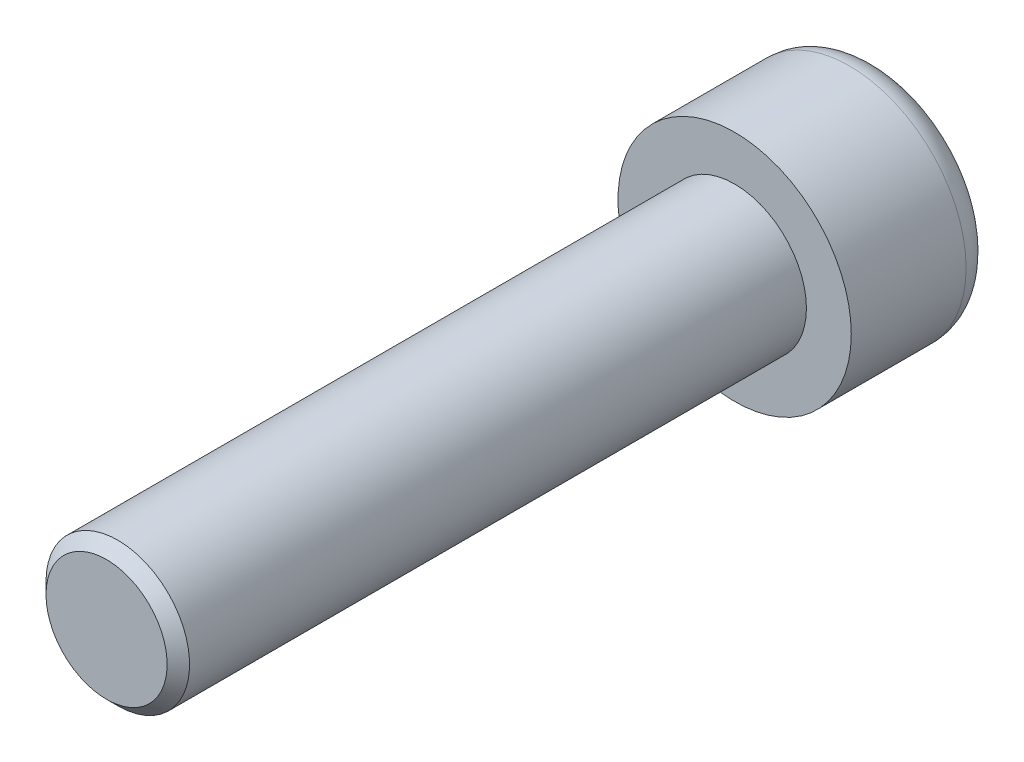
ISO-10303-21;
HEADER;
FILE_DESCRIPTION(('STEP AP214'),'2;1');
FILE_NAME('part.step','',(''),(''),'','','');
FILE_SCHEMA(('AUTOMOTIVE_DESIGN { 1 0 10303 214 1 1 1 1 }'));
ENDSEC;
DATA;
#1=APPLICATION_CONTEXT('core data for automotive mechanical design processes');
#2=APPLICATION_PROTOCOL_DEFINITION('international standard','automotive_design',2000,#1);
#3=PRODUCT_CONTEXT('',#1,'mechanical');
#4=PRODUCT('Part','Part','',(#3));
#5=PRODUCT_RELATED_PRODUCT_CATEGORY('part','',(#4));
#6=PRODUCT_DEFINITION_FORMATION('','',#4);
#7=PRODUCT_DEFINITION_CONTEXT('part definition',#1,'design');
#8=PRODUCT_DEFINITION('design','',#6,#7);
#9=PRODUCT_DEFINITION_SHAPE('','',#8);
#10=(LENGTH_UNIT() NAMED_UNIT(*) SI_UNIT(.MILLI.,.METRE.));
#11=(NAMED_UNIT(*) PLANE_ANGLE_UNIT() SI_UNIT($,.RADIAN.));
#12=(NAMED_UNIT(*) SI_UNIT($,.STERADIAN.) SOLID_ANGLE_UNIT());
#13=UNCERTAINTY_MEASURE_WITH_UNIT(LENGTH_MEASURE(1.E-05),#10,'distance_accuracy_value','');
#14=(GEOMETRIC_REPRESENTATION_CONTEXT(3) GLOBAL_UNCERTAINTY_ASSIGNED_CONTEXT((#13)) GLOBAL_UNIT_ASSIGNED_CONTEXT((#10,
#11,#12)) REPRESENTATION_CONTEXT('',''));
#15=CARTESIAN_POINT('',(0.,0.,0.));
#16=DIRECTION('',(0.,0.,1.));
#17=DIRECTION('',(1.,0.,0.));
#18=AXIS2_PLACEMENT_3D('',#15,#16,#17);
#19=CARTESIAN_POINT('',(0.,0.,8.00000000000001));
#20=DIRECTION('',(0.,0.,1.));
#21=DIRECTION('',(1.,0.,0.));
#22=AXIS2_PLACEMENT_3D('',#19,#20,#21);
#23=PLANE('',#22);
#24=CARTESIAN_POINT('',(0.,0.,8.00000000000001));
#25=DIRECTION('',(0.,0.,1.));
#26=DIRECTION('',(1.,0.,0.));
#27=AXIS2_PLACEMENT_3D('',#24,#25,#26);
#28=CIRCLE('',#27,6.5);
#29=CARTESIAN_POINT('',(6.5,0.,8.00000000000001));
#30=VERTEX_POINT('',#29);
#31=EDGE_CURVE('E134',#30,#30,#28,.T.);
#32=ORIENTED_EDGE('',*,*,#31,.T.);
#33=EDGE_LOOP('',(#32));
#34=FACE_BOUND('',#33,.T.);
#35=CARTESIAN_POINT('',(0.,0.,8.00000000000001));
#36=DIRECTION('',(0.,0.,1.));
#37=DIRECTION('',(1.,0.,0.));
#38=AXIS2_PLACEMENT_3D('',#35,#36,#37);
#39=CIRCLE('',#38,4.);
#40=CARTESIAN_POINT('',(4.,0.,8.00000000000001));
#41=VERTEX_POINT('',#40);
#42=EDGE_CURVE('E193',#41,#41,#39,.T.);
#43=ORIENTED_EDGE('',*,*,#42,.F.);
#44=EDGE_LOOP('',(#43));
#45=FACE_BOUND('',#44,.T.);
#46=ADVANCED_FACE('F32',(#34,#45),#23,.T.);
#47=CARTESIAN_POINT('',(0.,0.,8.00000000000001));
#48=DIRECTION('',(0.,0.,-1.));
#49=DIRECTION('',(-1.,0.,0.));
#50=AXIS2_PLACEMENT_3D('',#47,#48,#49);
#51=CYLINDRICAL_SURFACE('',#50,6.5);
#52=CARTESIAN_POINT('',(0.,0.,1.6));
#53=DIRECTION('',(0.,0.,1.));
#54=DIRECTION('',(1.,0.,0.));
#55=AXIS2_PLACEMENT_3D('',#52,#53,#54);
#56=CIRCLE('',#55,6.5);
#57=CARTESIAN_POINT('',(6.5,0.,1.6));
#58=VERTEX_POINT('',#57);
#59=EDGE_CURVE('E40',#58,#58,#56,.T.);
#60=ORIENTED_EDGE('',*,*,#59,.T.);
#61=EDGE_LOOP('',(#60));
#62=FACE_BOUND('',#61,.T.);
#63=ORIENTED_EDGE('',*,*,#31,.F.);
#64=EDGE_LOOP('',(#63));
#65=FACE_BOUND('',#64,.T.);
#66=ADVANCED_FACE('F34',(#62,#65),#51,.T.);
#67=CARTESIAN_POINT('',(0.,0.,0.));
#68=DIRECTION('',(0.,0.,1.));
#69=DIRECTION('',(1.,0.,0.));
#70=AXIS2_PLACEMENT_3D('',#67,#68,#69);
#71=PLANE('',#70);
#72=CARTESIAN_POINT('',(0.,0.,0.));
#73=DIRECTION('',(0.,0.,1.));
#74=DIRECTION('',(1.,0.,0.));
#75=AXIS2_PLACEMENT_3D('',#72,#73,#74);
#76=CIRCLE('',#75,4.9);
#77=CARTESIAN_POINT('',(4.9,0.,0.));
#78=VERTEX_POINT('',#77);
#79=EDGE_CURVE('E11',#78,#78,#76,.F.);
#80=ORIENTED_EDGE('',*,*,#79,.T.);
#81=EDGE_LOOP('',(#80));
#82=FACE_BOUND('',#81,.T.);
#83=DIRECTION('',(0.86602540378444,-0.499999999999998,0.));
#84=VECTOR('',#83,1.);
#85=CARTESIAN_POINT('',(0.,3.46410161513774,0.));
#86=LINE('',#85,#84);
#87=CARTESIAN_POINT('',(0.,3.46410161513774,0.));
#88=VERTEX_POINT('',#87);
#89=CARTESIAN_POINT('',(3.,1.73205080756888,0.));
#90=VERTEX_POINT('',#89);
#91=EDGE_CURVE('E101',#88,#90,#86,.T.);
#92=ORIENTED_EDGE('',*,*,#91,.F.);
#93=DIRECTION('',(0.86602540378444,0.499999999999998,0.));
#94=VECTOR('',#93,1.);
#95=CARTESIAN_POINT('',(0.,3.46410161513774,0.));
#96=LINE('',#95,#94);
#97=CARTESIAN_POINT('',(-3.,1.73205080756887,0.));
#98=VERTEX_POINT('',#97);
#99=EDGE_CURVE('E47',#98,#88,#96,.T.);
#100=ORIENTED_EDGE('',*,*,#99,.F.);
#101=DIRECTION('',(0.,1.,0.));
#102=VECTOR('',#101,1.);
#103=CARTESIAN_POINT('',(-3.,1.73205080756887,0.));
#104=LINE('',#103,#102);
#105=CARTESIAN_POINT('',(-3.,-1.73205080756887,0.));
#106=VERTEX_POINT('',#105);
#107=EDGE_CURVE('E116',#106,#98,#104,.T.);
#108=ORIENTED_EDGE('',*,*,#107,.F.);
#109=DIRECTION('',(-0.86602540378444,0.499999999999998,0.));
#110=VECTOR('',#109,1.);
#111=CARTESIAN_POINT('',(-3.,-1.73205080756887,0.));
#112=LINE('',#111,#110);
#113=CARTESIAN_POINT('',(0.,-3.46410161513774,0.));
#114=VERTEX_POINT('',#113);
#115=EDGE_CURVE('E110',#114,#106,#112,.T.);
#116=ORIENTED_EDGE('',*,*,#115,.F.);
#117=DIRECTION('',(-0.86602540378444,-0.499999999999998,0.));
#118=VECTOR('',#117,1.);
#119=CARTESIAN_POINT('',(3.,-1.73205080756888,0.));
#120=LINE('',#119,#118);
#121=CARTESIAN_POINT('',(3.,-1.73205080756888,0.));
#122=VERTEX_POINT('',#121);
#123=EDGE_CURVE('E108',#122,#114,#120,.T.);
#124=ORIENTED_EDGE('',*,*,#123,.F.);
#125=DIRECTION('',(0.,-1.,0.));
#126=VECTOR('',#125,1.);
#127=CARTESIAN_POINT('',(3.,1.73205080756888,0.));
#128=LINE('',#127,#126);
#129=EDGE_CURVE('E90',#90,#122,#128,.T.);
#130=ORIENTED_EDGE('',*,*,#129,.F.);
#131=EDGE_LOOP('',(#92,#100,#108,#116,#124,#130));
#132=FACE_BOUND('',#131,.T.);
#133=ADVANCED_FACE('F105',(#82,#132),#71,.F.);
#134=CARTESIAN_POINT('',(0.,3.46410161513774,5.));
#135=DIRECTION('',(-0.499999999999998,0.86602540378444,0.));
#136=DIRECTION('',(-0.86602540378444,-0.499999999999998,0.));
#137=AXIS2_PLACEMENT_3D('',#134,#135,#136);
#138=PLANE('',#137);
#139=ORIENTED_EDGE('',*,*,#99,.T.);
#140=DIRECTION('',(0.,0.,-1.));
#141=VECTOR('',#140,1.);
#142=CARTESIAN_POINT('',(0.,3.46410161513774,5.));
#143=LINE('',#142,#141);
#144=CARTESIAN_POINT('',(0.,3.46410161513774,5.));
#145=VERTEX_POINT('',#144);
#146=EDGE_CURVE('E98',#145,#88,#143,.T.);
#147=ORIENTED_EDGE('',*,*,#146,.F.);
#148=DIRECTION('',(0.86602540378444,0.499999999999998,0.));
#149=VECTOR('',#148,1.);
#150=CARTESIAN_POINT('',(0.,3.46410161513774,5.));
#151=LINE('',#150,#149);
#152=CARTESIAN_POINT('',(-3.,1.73205080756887,5.));
#153=VERTEX_POINT('',#152);
#154=EDGE_CURVE('E118',#153,#145,#151,.T.);
#155=ORIENTED_EDGE('',*,*,#154,.F.);
#156=DIRECTION('',(0.,0.,-1.));
#157=VECTOR('',#156,1.);
#158=CARTESIAN_POINT('',(-3.,1.73205080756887,5.));
#159=LINE('',#158,#157);
#160=EDGE_CURVE('E54',#153,#98,#159,.T.);
#161=ORIENTED_EDGE('',*,*,#160,.T.);
#162=EDGE_LOOP('',(#139,#147,#155,#161));
#163=FACE_BOUND('',#162,.T.);
#164=ADVANCED_FACE('F172',(#163),#138,.F.);
#165=CARTESIAN_POINT('',(-3.,1.73205080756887,5.));
#166=DIRECTION('',(-1.,0.,0.));
#167=DIRECTION('',(0.,0.,1.));
#168=AXIS2_PLACEMENT_3D('',#165,#166,#167);
#169=PLANE('',#168);
#170=ORIENTED_EDGE('',*,*,#107,.T.);
#171=ORIENTED_EDGE('',*,*,#160,.F.);
#172=DIRECTION('',(0.,1.,0.));
#173=VECTOR('',#172,1.);
#174=CARTESIAN_POINT('',(-3.,1.73205080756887,5.));
#175=LINE('',#174,#173);
#176=CARTESIAN_POINT('',(-3.,-1.73205080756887,5.));
#177=VERTEX_POINT('',#176);
#178=EDGE_CURVE('E130',#177,#153,#175,.T.);
#179=ORIENTED_EDGE('',*,*,#178,.F.);
#180=DIRECTION('',(0.,0.,-1.));
#181=VECTOR('',#180,1.);
#182=CARTESIAN_POINT('',(-3.,-1.73205080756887,5.));
#183=LINE('',#182,#181);
#184=EDGE_CURVE('E135',#177,#106,#183,.T.);
#185=ORIENTED_EDGE('',*,*,#184,.T.);
#186=EDGE_LOOP('',(#170,#171,#179,#185));
#187=FACE_BOUND('',#186,.T.);
#188=ADVANCED_FACE('F176',(#187),#169,.F.);
#189=CARTESIAN_POINT('',(-3.,-1.73205080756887,5.));
#190=DIRECTION('',(-0.499999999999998,-0.86602540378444,0.));
#191=DIRECTION('',(0.86602540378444,-0.499999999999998,0.));
#192=AXIS2_PLACEMENT_3D('',#189,#190,#191);
#193=PLANE('',#192);
#194=ORIENTED_EDGE('',*,*,#115,.T.);
#195=ORIENTED_EDGE('',*,*,#184,.F.);
#196=DIRECTION('',(-0.86602540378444,0.499999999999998,0.));
#197=VECTOR('',#196,1.);
#198=CARTESIAN_POINT('',(-3.,-1.73205080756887,5.));
#199=LINE('',#198,#197);
#200=CARTESIAN_POINT('',(0.,-3.46410161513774,5.));
#201=VERTEX_POINT('',#200);
#202=EDGE_CURVE('E127',#201,#177,#199,.T.);
#203=ORIENTED_EDGE('',*,*,#202,.F.);
#204=DIRECTION('',(0.,0.,-1.));
#205=VECTOR('',#204,1.);
#206=CARTESIAN_POINT('',(0.,-3.46410161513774,5.));
#207=LINE('',#206,#205);
#208=EDGE_CURVE('E137',#201,#114,#207,.T.);
#209=ORIENTED_EDGE('',*,*,#208,.T.);
#210=EDGE_LOOP('',(#194,#195,#203,#209));
#211=FACE_BOUND('',#210,.T.);
#212=ADVANCED_FACE('F184',(#211),#193,.F.);
#213=CARTESIAN_POINT('',(3.,-1.73205080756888,5.));
#214=DIRECTION('',(0.499999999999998,-0.86602540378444,0.));
#215=DIRECTION('',(0.86602540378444,0.499999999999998,0.));
#216=AXIS2_PLACEMENT_3D('',#213,#214,#215);
#217=PLANE('',#216);
#218=ORIENTED_EDGE('',*,*,#123,.T.);
#219=ORIENTED_EDGE('',*,*,#208,.F.);
#220=DIRECTION('',(-0.86602540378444,-0.499999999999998,0.));
#221=VECTOR('',#220,1.);
#222=CARTESIAN_POINT('',(3.,-1.73205080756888,5.));
#223=LINE('',#222,#221);
#224=CARTESIAN_POINT('',(3.,-1.73205080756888,5.));
#225=VERTEX_POINT('',#224);
#226=EDGE_CURVE('E124',#225,#201,#223,.T.);
#227=ORIENTED_EDGE('',*,*,#226,.F.);
#228=DIRECTION('',(0.,0.,-1.));
#229=VECTOR('',#228,1.);
#230=CARTESIAN_POINT('',(3.,-1.73205080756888,5.));
#231=LINE('',#230,#229);
#232=EDGE_CURVE('E97',#225,#122,#231,.T.);
#233=ORIENTED_EDGE('',*,*,#232,.T.);
#234=EDGE_LOOP('',(#218,#219,#227,#233));
#235=FACE_BOUND('',#234,.T.);
#236=ADVANCED_FACE('F181',(#235),#217,.F.);
#237=CARTESIAN_POINT('',(3.,1.73205080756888,5.));
#238=DIRECTION('',(1.,0.,0.));
#239=DIRECTION('',(0.,0.,-1.));
#240=AXIS2_PLACEMENT_3D('',#237,#238,#239);
#241=PLANE('',#240);
#242=ORIENTED_EDGE('',*,*,#129,.T.);
#243=ORIENTED_EDGE('',*,*,#232,.F.);
#244=DIRECTION('',(0.,-1.,0.));
#245=VECTOR('',#244,1.);
#246=CARTESIAN_POINT('',(3.,1.73205080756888,5.));
#247=LINE('',#246,#245);
#248=CARTESIAN_POINT('',(3.,1.73205080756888,5.));
#249=VERTEX_POINT('',#248);
#250=EDGE_CURVE('E93',#249,#225,#247,.T.);
#251=ORIENTED_EDGE('',*,*,#250,.F.);
#252=DIRECTION('',(0.,0.,-1.));
#253=VECTOR('',#252,1.);
#254=CARTESIAN_POINT('',(3.,1.73205080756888,5.));
#255=LINE('',#254,#253);
#256=EDGE_CURVE('E86',#249,#90,#255,.T.);
#257=ORIENTED_EDGE('',*,*,#256,.T.);
#258=EDGE_LOOP('',(#242,#243,#251,#257));
#259=FACE_BOUND('',#258,.T.);
#260=ADVANCED_FACE('F88',(#259),#241,.F.);
#261=CARTESIAN_POINT('',(0.,3.46410161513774,5.));
#262=DIRECTION('',(0.499999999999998,0.86602540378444,0.));
#263=DIRECTION('',(-0.86602540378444,0.499999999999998,0.));
#264=AXIS2_PLACEMENT_3D('',#261,#262,#263);
#265=PLANE('',#264);
#266=ORIENTED_EDGE('',*,*,#91,.T.);
#267=ORIENTED_EDGE('',*,*,#256,.F.);
#268=DIRECTION('',(0.86602540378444,-0.499999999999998,0.));
#269=VECTOR('',#268,1.);
#270=CARTESIAN_POINT('',(0.,3.46410161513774,5.));
#271=LINE('',#270,#269);
#272=EDGE_CURVE('E121',#145,#249,#271,.T.);
#273=ORIENTED_EDGE('',*,*,#272,.F.);
#274=ORIENTED_EDGE('',*,*,#146,.T.);
#275=EDGE_LOOP('',(#266,#267,#273,#274));
#276=FACE_BOUND('',#275,.T.);
#277=ADVANCED_FACE('F102',(#276),#265,.F.);
#278=CARTESIAN_POINT('',(-3.,1.73205080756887,5.));
#279=DIRECTION('',(0.,0.,1.));
#280=DIRECTION('',(1.,0.,0.));
#281=AXIS2_PLACEMENT_3D('',#278,#279,#280);
#282=PLANE('',#281);
#283=ORIENTED_EDGE('',*,*,#154,.T.);
#284=ORIENTED_EDGE('',*,*,#272,.T.);
#285=ORIENTED_EDGE('',*,*,#250,.T.);
#286=ORIENTED_EDGE('',*,*,#226,.T.);
#287=ORIENTED_EDGE('',*,*,#202,.T.);
#288=ORIENTED_EDGE('',*,*,#178,.T.);
#289=EDGE_LOOP('',(#283,#284,#285,#286,#287,#288));
#290=FACE_BOUND('',#289,.T.);
#291=ADVANCED_FACE('F150',(#290),#282,.F.);
#292=CARTESIAN_POINT('',(0.,0.,1.6));
#293=DIRECTION('',(0.,0.,1.));
#294=DIRECTION('',(1.,0.,0.));
#295=AXIS2_PLACEMENT_3D('',#292,#293,#294);
#296=TOROIDAL_SURFACE('',#295,4.9,1.6);
#297=ORIENTED_EDGE('',*,*,#79,.F.);
#298=EDGE_LOOP('',(#297));
#299=FACE_BOUND('',#298,.T.);
#300=ORIENTED_EDGE('',*,*,#59,.F.);
#301=EDGE_LOOP('',(#300));
#302=FACE_BOUND('',#301,.T.);
#303=ADVANCED_FACE('F147',(#299,#302),#296,.T.);
#304=CARTESIAN_POINT('',(0.,0.,43.));
#305=DIRECTION('',(0.,0.,-1.));
#306=DIRECTION('',(-1.,0.,0.));
#307=AXIS2_PLACEMENT_3D('',#304,#305,#306);
#308=CYLINDRICAL_SURFACE('',#307,4.);
#309=CARTESIAN_POINT('',(0.,0.,42.3749999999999));
#310=DIRECTION('',(0.,0.,-1.));
#311=DIRECTION('',(-1.,0.,0.));
#312=AXIS2_PLACEMENT_3D('',#309,#310,#311);
#313=CIRCLE('',#312,4.);
#314=CARTESIAN_POINT('',(-4.,0.,42.3749999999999));
#315=VERTEX_POINT('',#314);
#316=EDGE_CURVE('E200',#315,#315,#313,.T.);
#317=ORIENTED_EDGE('',*,*,#316,.T.);
#318=EDGE_LOOP('',(#317));
#319=FACE_BOUND('',#318,.T.);
#320=ORIENTED_EDGE('',*,*,#42,.T.);
#321=EDGE_LOOP('',(#320));
#322=FACE_BOUND('',#321,.T.);
#323=ADVANCED_FACE('F149',(#319,#322),#308,.T.);
#324=CARTESIAN_POINT('',(0.,0.,43.));
#325=DIRECTION('',(0.,0.,-1.));
#326=DIRECTION('',(-1.,0.,0.));
#327=AXIS2_PLACEMENT_3D('',#324,#325,#326);
#328=CONICAL_SURFACE('',#327,3.375,0.785398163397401);
#329=ORIENTED_EDGE('',*,*,#316,.F.);
#330=EDGE_LOOP('',(#329));
#331=FACE_BOUND('',#330,.T.);
#332=CARTESIAN_POINT('',(0.,0.,43.));
#333=DIRECTION('',(0.,0.,-1.));
#334=DIRECTION('',(-1.,0.,0.));
#335=AXIS2_PLACEMENT_3D('',#332,#333,#334);
#336=CIRCLE('',#335,3.375);
#337=CARTESIAN_POINT('',(-3.375,0.,43.));
#338=VERTEX_POINT('',#337);
#339=EDGE_CURVE('E195',#338,#338,#336,.T.);
#340=ORIENTED_EDGE('',*,*,#339,.T.);
#341=EDGE_LOOP('',(#340));
#342=FACE_BOUND('',#341,.T.);
#343=ADVANCED_FACE('F157',(#331,#342),#328,.T.);
#344=CARTESIAN_POINT('',(0.,0.,43.));
#345=DIRECTION('',(0.,0.,1.));
#346=DIRECTION('',(1.,0.,0.));
#347=AXIS2_PLACEMENT_3D('',#344,#345,#346);
#348=PLANE('',#347);
#349=ORIENTED_EDGE('',*,*,#339,.F.);
#350=EDGE_LOOP('',(#349));
#351=FACE_BOUND('',#350,.T.);
#352=ADVANCED_FACE('F207',(#351),#348,.T.);
#353=CLOSED_SHELL('',(#46,#66,#133,#164,#188,#212,#236,#260,#277,#291,#303,#323,#343,#352));
#354=MANIFOLD_SOLID_BREP('B2',#353);
#355=ADVANCED_BREP_SHAPE_REPRESENTATION('',(#18,#354),#14);
#356=SHAPE_DEFINITION_REPRESENTATION(#9,#355);
ENDSEC;
END-ISO-10303-21;
